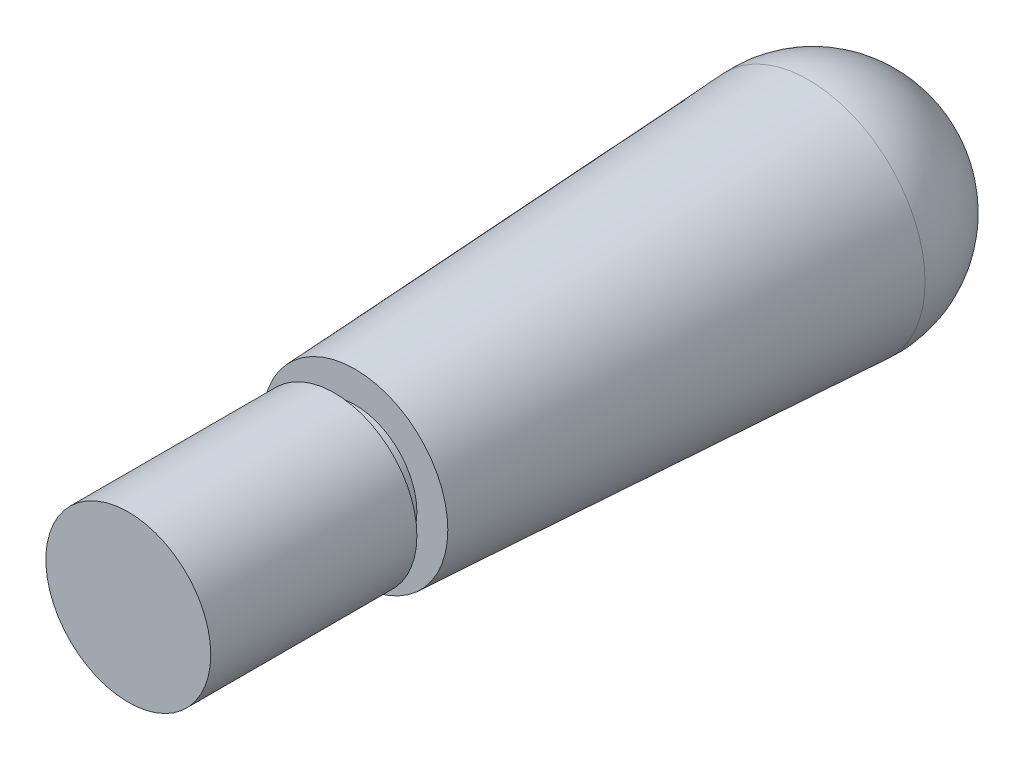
ISO-10303-21;
HEADER;
FILE_DESCRIPTION(('STEP AP214'),'2;1');
FILE_NAME('part.step','',(''),(''),'','','');
FILE_SCHEMA(('AUTOMOTIVE_DESIGN { 1 0 10303 214 1 1 1 1 }'));
ENDSEC;
DATA;
#1=APPLICATION_CONTEXT('core data for automotive mechanical design processes');
#2=APPLICATION_PROTOCOL_DEFINITION('international standard','automotive_design',2000,#1);
#3=PRODUCT_CONTEXT('',#1,'mechanical');
#4=PRODUCT('Part','Part','',(#3));
#5=PRODUCT_RELATED_PRODUCT_CATEGORY('part','',(#4));
#6=PRODUCT_DEFINITION_FORMATION('','',#4);
#7=PRODUCT_DEFINITION_CONTEXT('part definition',#1,'design');
#8=PRODUCT_DEFINITION('design','',#6,#7);
#9=PRODUCT_DEFINITION_SHAPE('','',#8);
#10=(LENGTH_UNIT() NAMED_UNIT(*) SI_UNIT(.MILLI.,.METRE.));
#11=(NAMED_UNIT(*) PLANE_ANGLE_UNIT() SI_UNIT($,.RADIAN.));
#12=(NAMED_UNIT(*) SI_UNIT($,.STERADIAN.) SOLID_ANGLE_UNIT());
#13=UNCERTAINTY_MEASURE_WITH_UNIT(LENGTH_MEASURE(1.E-05),#10,'distance_accuracy_value','');
#14=(GEOMETRIC_REPRESENTATION_CONTEXT(3) GLOBAL_UNCERTAINTY_ASSIGNED_CONTEXT((#13)) GLOBAL_UNIT_ASSIGNED_CONTEXT((#10,
#11,#12)) REPRESENTATION_CONTEXT('',''));
#15=CARTESIAN_POINT('',(0.,0.,0.));
#16=DIRECTION('',(0.,0.,1.));
#17=DIRECTION('',(1.,0.,0.));
#18=AXIS2_PLACEMENT_3D('',#15,#16,#17);
#19=CARTESIAN_POINT('',(0.,101.6,0.));
#20=DIRECTION('',(0.,0.,-1.));
#21=DIRECTION('',(-1.,0.,0.));
#22=AXIS2_PLACEMENT_3D('',#19,#20,#21);
#23=PLANE('',#22);
#24=CARTESIAN_POINT('',(0.,0.,0.));
#25=DIRECTION('',(0.,0.,1.));
#26=DIRECTION('',(1.,0.,0.));
#27=AXIS2_PLACEMENT_3D('',#24,#25,#26);
#28=CIRCLE('',#27,101.6);
#29=CARTESIAN_POINT('',(101.6,0.,0.));
#30=VERTEX_POINT('',#29);
#31=EDGE_CURVE('E11',#30,#30,#28,.T.);
#32=ORIENTED_EDGE('',*,*,#31,.T.);
#33=EDGE_LOOP('',(#32));
#34=FACE_BOUND('',#33,.T.);
#35=ADVANCED_FACE('F38',(#34),#23,.F.);
#36=CARTESIAN_POINT('',(0.,0.,0.));
#37=DIRECTION('',(0.,0.,1.));
#38=DIRECTION('',(1.,0.,0.));
#39=AXIS2_PLACEMENT_3D('',#36,#37,#38);
#40=CYLINDRICAL_SURFACE('',#39,101.6);
#41=ORIENTED_EDGE('',*,*,#31,.F.);
#42=EDGE_LOOP('',(#41));
#43=FACE_BOUND('',#42,.T.);
#44=CARTESIAN_POINT('',(0.,0.,-254.));
#45=DIRECTION('',(0.,0.,1.));
#46=DIRECTION('',(1.,0.,0.));
#47=AXIS2_PLACEMENT_3D('',#44,#45,#46);
#48=CIRCLE('',#47,101.6);
#49=CARTESIAN_POINT('',(101.6,0.,-254.));
#50=VERTEX_POINT('',#49);
#51=EDGE_CURVE('E44',#50,#50,#48,.T.);
#52=ORIENTED_EDGE('',*,*,#51,.T.);
#53=EDGE_LOOP('',(#52));
#54=FACE_BOUND('',#53,.T.);
#55=ADVANCED_FACE('F60',(#43,#54),#40,.T.);
#56=CARTESIAN_POINT('',(0.,101.6,-254.));
#57=DIRECTION('',(0.,0.,1.));
#58=DIRECTION('',(1.,0.,0.));
#59=AXIS2_PLACEMENT_3D('',#56,#57,#58);
#60=PLANE('',#59);
#61=ORIENTED_EDGE('',*,*,#51,.F.);
#62=EDGE_LOOP('',(#61));
#63=FACE_BOUND('',#62,.T.);
#64=CARTESIAN_POINT('',(0.,0.,-254.));
#65=DIRECTION('',(0.,0.,1.));
#66=DIRECTION('',(1.,0.,0.));
#67=AXIS2_PLACEMENT_3D('',#64,#65,#66);
#68=CIRCLE('',#67,76.2);
#69=CARTESIAN_POINT('',(76.2,0.,-254.));
#70=VERTEX_POINT('',#69);
#71=EDGE_CURVE('E72',#70,#70,#68,.T.);
#72=ORIENTED_EDGE('',*,*,#71,.T.);
#73=EDGE_LOOP('',(#72));
#74=FACE_BOUND('',#73,.T.);
#75=ADVANCED_FACE('F65',(#63,#74),#60,.F.);
#76=CARTESIAN_POINT('',(0.,0.,0.));
#77=DIRECTION('',(0.,0.,1.));
#78=DIRECTION('',(1.,0.,0.));
#79=AXIS2_PLACEMENT_3D('',#76,#77,#78);
#80=CYLINDRICAL_SURFACE('',#79,76.2);
#81=ORIENTED_EDGE('',*,*,#71,.F.);
#82=EDGE_LOOP('',(#81));
#83=FACE_BOUND('',#82,.T.);
#84=CARTESIAN_POINT('',(0.,0.,-279.4));
#85=DIRECTION('',(0.,0.,1.));
#86=DIRECTION('',(1.,0.,0.));
#87=AXIS2_PLACEMENT_3D('',#84,#85,#86);
#88=CIRCLE('',#87,76.2);
#89=CARTESIAN_POINT('',(76.2,0.,-279.4));
#90=VERTEX_POINT('',#89);
#91=EDGE_CURVE('E74',#90,#90,#88,.T.);
#92=ORIENTED_EDGE('',*,*,#91,.T.);
#93=EDGE_LOOP('',(#92));
#94=FACE_BOUND('',#93,.T.);
#95=ADVANCED_FACE('F88',(#83,#94),#80,.T.);
#96=CARTESIAN_POINT('',(0.,76.2,-279.4));
#97=DIRECTION('',(0.,0.,-1.));
#98=DIRECTION('',(-1.,0.,0.));
#99=AXIS2_PLACEMENT_3D('',#96,#97,#98);
#100=PLANE('',#99);
#101=ORIENTED_EDGE('',*,*,#91,.F.);
#102=EDGE_LOOP('',(#101));
#103=FACE_BOUND('',#102,.T.);
#104=CARTESIAN_POINT('',(0.,0.,-279.4));
#105=DIRECTION('',(0.,0.,1.));
#106=DIRECTION('',(1.,0.,0.));
#107=AXIS2_PLACEMENT_3D('',#104,#105,#106);
#108=CIRCLE('',#107,114.3);
#109=CARTESIAN_POINT('',(114.3,0.,-279.4));
#110=VERTEX_POINT('',#109);
#111=EDGE_CURVE('E79',#110,#110,#108,.T.);
#112=ORIENTED_EDGE('',*,*,#111,.T.);
#113=EDGE_LOOP('',(#112));
#114=FACE_BOUND('',#113,.T.);
#115=ADVANCED_FACE('F55',(#103,#114),#100,.F.);
#116=CARTESIAN_POINT('',(0.,0.,-838.2));
#117=DIRECTION('',(0.,0.,-1.));
#118=DIRECTION('',(-1.,0.,0.));
#119=AXIS2_PLACEMENT_3D('',#116,#117,#118);
#120=CONICAL_SURFACE('',#119,143.585467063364,0.0523598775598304);
#121=ORIENTED_EDGE('',*,*,#111,.F.);
#122=EDGE_LOOP('',(#121));
#123=FACE_BOUND('',#122,.T.);
#124=CARTESIAN_POINT('',(0.,0.,-838.2));
#125=DIRECTION('',(0.,0.,1.));
#126=DIRECTION('',(1.,0.,0.));
#127=AXIS2_PLACEMENT_3D('',#124,#125,#126);
#128=CIRCLE('',#127,143.585467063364);
#129=CARTESIAN_POINT('',(143.585467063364,0.,-838.2));
#130=VERTEX_POINT('',#129);
#131=EDGE_CURVE('E82',#130,#130,#128,.T.);
#132=ORIENTED_EDGE('',*,*,#131,.T.);
#133=EDGE_LOOP('',(#132));
#134=FACE_BOUND('',#133,.T.);
#135=ADVANCED_FACE('F49',(#123,#134),#120,.T.);
#136=CARTESIAN_POINT('',(4.07692105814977,0.,-845.511333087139));
#137=DIRECTION('',(0.,-1.,0.));
#138=DIRECTION('',(1.,0.,0.));
#139=AXIS2_PLACEMENT_3D('',#136,#137,#138);
#140=CIRCLE('',#139,139.7);
#141=TRIMMED_CURVE('',#140,(PARAMETER_VALUE(-1.59998387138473)),
(PARAMETER_VALUE(1.59998387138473)),.T.,.PARAMETER.);
#142=CARTESIAN_POINT('',(0.,0.,-845.511333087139));
#143=DIRECTION('',(0.,0.,1.));
#144=AXIS1_PLACEMENT('',#142,#143);
#145=SURFACE_OF_REVOLUTION('',#141,#144);
#146=ORIENTED_EDGE('',*,*,#131,.F.);
#147=EDGE_LOOP('',(#146));
#148=FACE_BOUND('',#147,.T.);
#149=CARTESIAN_POINT('',(0.,0.,-985.151831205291));
#150=VERTEX_POINT('',#149);
#151=VERTEX_LOOP('',#150);
#152=FACE_BOUND('',#151,.T.);
#153=ADVANCED_FACE('F47',(#148,#152),#145,.T.);
#154=CLOSED_SHELL('',(#35,#55,#75,#95,#115,#135,#153));
#155=MANIFOLD_SOLID_BREP('B2',#154);
#156=ADVANCED_BREP_SHAPE_REPRESENTATION('',(#18,#155),#14);
#157=SHAPE_DEFINITION_REPRESENTATION(#9,#156);
ENDSEC;
END-ISO-10303-21;
